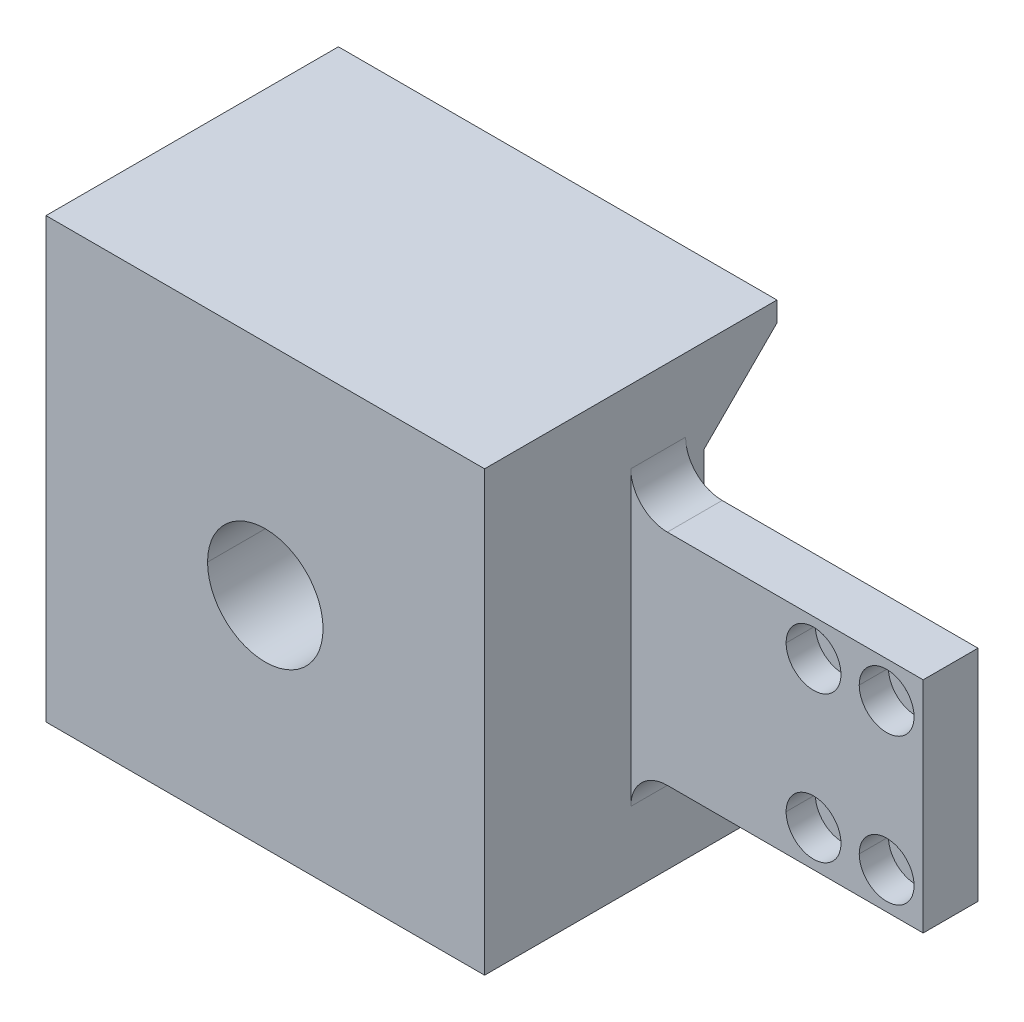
ISO-10303-21;
HEADER;
FILE_DESCRIPTION(('STEP AP214'),'2;1');
FILE_NAME('part.step','',(''),(''),'','','');
FILE_SCHEMA(('AUTOMOTIVE_DESIGN { 1 0 10303 214 1 1 1 1 }'));
ENDSEC;
DATA;
#1=APPLICATION_CONTEXT('core data for automotive mechanical design processes');
#2=APPLICATION_PROTOCOL_DEFINITION('international standard','automotive_design',2000,#1);
#3=PRODUCT_CONTEXT('',#1,'mechanical');
#4=PRODUCT('Part','Part','',(#3));
#5=PRODUCT_RELATED_PRODUCT_CATEGORY('part','',(#4));
#6=PRODUCT_DEFINITION_FORMATION('','',#4);
#7=PRODUCT_DEFINITION_CONTEXT('part definition',#1,'design');
#8=PRODUCT_DEFINITION('design','',#6,#7);
#9=PRODUCT_DEFINITION_SHAPE('','',#8);
#10=(LENGTH_UNIT() NAMED_UNIT(*) SI_UNIT(.MILLI.,.METRE.));
#11=(NAMED_UNIT(*) PLANE_ANGLE_UNIT() SI_UNIT($,.RADIAN.));
#12=(NAMED_UNIT(*) SI_UNIT($,.STERADIAN.) SOLID_ANGLE_UNIT());
#13=UNCERTAINTY_MEASURE_WITH_UNIT(LENGTH_MEASURE(1.E-05),#10,'distance_accuracy_value','');
#14=(GEOMETRIC_REPRESENTATION_CONTEXT(3) GLOBAL_UNCERTAINTY_ASSIGNED_CONTEXT((#13)) GLOBAL_UNIT_ASSIGNED_CONTEXT((#10,
#11,#12)) REPRESENTATION_CONTEXT('',''));
#15=CARTESIAN_POINT('',(0.,0.,0.));
#16=DIRECTION('',(0.,0.,1.));
#17=DIRECTION('',(1.,0.,0.));
#18=AXIS2_PLACEMENT_3D('',#15,#16,#17);
#19=CARTESIAN_POINT('',(57.15,12.7,-5.079999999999));
#20=DIRECTION('',(0.,0.,-1.));
#21=DIRECTION('',(0.,1.,0.));
#22=AXIS2_PLACEMENT_3D('',#19,#20,#21);
#23=PLANE('',#22);
#24=CARTESIAN_POINT('',(57.15,12.7,-5.079999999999));
#25=DIRECTION('',(0.,0.,-1.));
#26=DIRECTION('',(0.,1.,0.));
#27=AXIS2_PLACEMENT_3D('',#24,#25,#26);
#28=CIRCLE('',#27,2.4384);
#29=CARTESIAN_POINT('',(54.7116,12.7,-5.079999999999));
#30=VERTEX_POINT('',#29);
#31=CARTESIAN_POINT('',(59.5884,12.7,-5.07999999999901));
#32=VERTEX_POINT('',#31);
#33=EDGE_CURVE('E258',#30,#32,#28,.T.);
#34=ORIENTED_EDGE('',*,*,#33,.T.);
#35=CARTESIAN_POINT('',(57.15,12.7,-5.079999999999));
#36=DIRECTION('',(0.,0.,-1.));
#37=DIRECTION('',(0.,1.,0.));
#38=AXIS2_PLACEMENT_3D('',#35,#36,#37);
#39=CIRCLE('',#38,2.4384);
#40=EDGE_CURVE('E261',#32,#30,#39,.T.);
#41=ORIENTED_EDGE('',*,*,#40,.T.);
#42=EDGE_LOOP('',(#34,#41));
#43=FACE_BOUND('',#42,.T.);
#44=CARTESIAN_POINT('',(57.15,12.7,-5.07999999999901));
#45=DIRECTION('',(0.,0.,-1.));
#46=DIRECTION('',(0.,1.,0.));
#47=AXIS2_PLACEMENT_3D('',#44,#45,#46);
#48=CIRCLE('',#47,4.7625);
#49=CARTESIAN_POINT('',(52.3875,12.7,-5.079999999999));
#50=VERTEX_POINT('',#49);
#51=CARTESIAN_POINT('',(61.9125,12.7,-5.07999999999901));
#52=VERTEX_POINT('',#51);
#53=EDGE_CURVE('E19',#50,#52,#48,.F.);
#54=ORIENTED_EDGE('',*,*,#53,.T.);
#55=CARTESIAN_POINT('',(57.15,12.7,-5.079999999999));
#56=DIRECTION('',(0.,0.,-1.));
#57=DIRECTION('',(0.,1.,0.));
#58=AXIS2_PLACEMENT_3D('',#55,#56,#57);
#59=CIRCLE('',#58,4.7625);
#60=EDGE_CURVE('E222',#52,#50,#59,.F.);
#61=ORIENTED_EDGE('',*,*,#60,.T.);
#62=EDGE_LOOP('',(#54,#61));
#63=FACE_BOUND('',#62,.T.);
#64=ADVANCED_FACE('F16',(#43,#63),#23,.F.);
#65=CARTESIAN_POINT('',(44.45,12.7,-5.079999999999));
#66=DIRECTION('',(0.,0.,-1.));
#67=DIRECTION('',(0.,1.,0.));
#68=AXIS2_PLACEMENT_3D('',#65,#66,#67);
#69=PLANE('',#68);
#70=CARTESIAN_POINT('',(44.45,12.7,-5.079999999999));
#71=DIRECTION('',(0.,0.,-1.));
#72=DIRECTION('',(0.,1.,0.));
#73=AXIS2_PLACEMENT_3D('',#70,#71,#72);
#74=CIRCLE('',#73,2.4384);
#75=CARTESIAN_POINT('',(42.0116,12.7,-5.079999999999));
#76=VERTEX_POINT('',#75);
#77=CARTESIAN_POINT('',(46.8884,12.7,-5.07999999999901));
#78=VERTEX_POINT('',#77);
#79=EDGE_CURVE('E264',#76,#78,#74,.T.);
#80=ORIENTED_EDGE('',*,*,#79,.T.);
#81=CARTESIAN_POINT('',(44.45,12.7,-5.079999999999));
#82=DIRECTION('',(0.,0.,-1.));
#83=DIRECTION('',(0.,1.,0.));
#84=AXIS2_PLACEMENT_3D('',#81,#82,#83);
#85=CIRCLE('',#84,2.4384);
#86=EDGE_CURVE('E267',#78,#76,#85,.T.);
#87=ORIENTED_EDGE('',*,*,#86,.T.);
#88=EDGE_LOOP('',(#80,#87));
#89=FACE_BOUND('',#88,.T.);
#90=CARTESIAN_POINT('',(44.45,12.7,-5.07999999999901));
#91=DIRECTION('',(0.,0.,-1.));
#92=DIRECTION('',(0.,1.,0.));
#93=AXIS2_PLACEMENT_3D('',#90,#91,#92);
#94=CIRCLE('',#93,4.7625);
#95=CARTESIAN_POINT('',(39.6875,12.7,-5.079999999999));
#96=VERTEX_POINT('',#95);
#97=CARTESIAN_POINT('',(49.2125,12.7,-5.07999999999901));
#98=VERTEX_POINT('',#97);
#99=EDGE_CURVE('E238',#96,#98,#94,.F.);
#100=ORIENTED_EDGE('',*,*,#99,.T.);
#101=CARTESIAN_POINT('',(44.45,12.7,-5.079999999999));
#102=DIRECTION('',(0.,0.,-1.));
#103=DIRECTION('',(0.,1.,0.));
#104=AXIS2_PLACEMENT_3D('',#101,#102,#103);
#105=CIRCLE('',#104,4.7625);
#106=EDGE_CURVE('E243',#98,#96,#105,.F.);
#107=ORIENTED_EDGE('',*,*,#106,.T.);
#108=EDGE_LOOP('',(#100,#107));
#109=FACE_BOUND('',#108,.T.);
#110=ADVANCED_FACE('F807',(#89,#109),#69,.F.);
#111=CARTESIAN_POINT('',(44.45,-12.7,-5.079999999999));
#112=DIRECTION('',(0.,0.,-1.));
#113=DIRECTION('',(0.,1.,0.));
#114=AXIS2_PLACEMENT_3D('',#111,#112,#113);
#115=PLANE('',#114);
#116=CARTESIAN_POINT('',(44.45,-12.7,-5.079999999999));
#117=DIRECTION('',(0.,0.,-1.));
#118=DIRECTION('',(0.,1.,0.));
#119=AXIS2_PLACEMENT_3D('',#116,#117,#118);
#120=CIRCLE('',#119,2.4384);
#121=CARTESIAN_POINT('',(42.0116,-12.7,-5.079999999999));
#122=VERTEX_POINT('',#121);
#123=CARTESIAN_POINT('',(46.8884,-12.7,-5.07999999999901));
#124=VERTEX_POINT('',#123);
#125=EDGE_CURVE('E270',#122,#124,#120,.T.);
#126=ORIENTED_EDGE('',*,*,#125,.T.);
#127=CARTESIAN_POINT('',(44.45,-12.7,-5.079999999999));
#128=DIRECTION('',(0.,0.,-1.));
#129=DIRECTION('',(0.,1.,0.));
#130=AXIS2_PLACEMENT_3D('',#127,#128,#129);
#131=CIRCLE('',#130,2.4384);
#132=EDGE_CURVE('E273',#124,#122,#131,.T.);
#133=ORIENTED_EDGE('',*,*,#132,.T.);
#134=EDGE_LOOP('',(#126,#133));
#135=FACE_BOUND('',#134,.T.);
#136=CARTESIAN_POINT('',(44.45,-12.7,-5.07999999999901));
#137=DIRECTION('',(0.,0.,-1.));
#138=DIRECTION('',(0.,1.,0.));
#139=AXIS2_PLACEMENT_3D('',#136,#137,#138);
#140=CIRCLE('',#139,4.7625);
#141=CARTESIAN_POINT('',(39.6875,-12.7,-5.079999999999));
#142=VERTEX_POINT('',#141);
#143=CARTESIAN_POINT('',(49.2125,-12.7,-5.07999999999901));
#144=VERTEX_POINT('',#143);
#145=EDGE_CURVE('E246',#142,#144,#140,.F.);
#146=ORIENTED_EDGE('',*,*,#145,.T.);
#147=CARTESIAN_POINT('',(44.45,-12.7,-5.079999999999));
#148=DIRECTION('',(0.,0.,-1.));
#149=DIRECTION('',(0.,1.,0.));
#150=AXIS2_PLACEMENT_3D('',#147,#148,#149);
#151=CIRCLE('',#150,4.7625);
#152=EDGE_CURVE('E249',#144,#142,#151,.F.);
#153=ORIENTED_EDGE('',*,*,#152,.T.);
#154=EDGE_LOOP('',(#146,#153));
#155=FACE_BOUND('',#154,.T.);
#156=ADVANCED_FACE('F799',(#135,#155),#115,.F.);
#157=CARTESIAN_POINT('',(57.15,-12.7,-5.079999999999));
#158=DIRECTION('',(0.,0.,-1.));
#159=DIRECTION('',(0.,1.,0.));
#160=AXIS2_PLACEMENT_3D('',#157,#158,#159);
#161=PLANE('',#160);
#162=CARTESIAN_POINT('',(57.15,-12.7,-5.079999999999));
#163=DIRECTION('',(0.,0.,-1.));
#164=DIRECTION('',(0.,1.,0.));
#165=AXIS2_PLACEMENT_3D('',#162,#163,#164);
#166=CIRCLE('',#165,2.4384);
#167=CARTESIAN_POINT('',(54.7116,-12.7,-5.079999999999));
#168=VERTEX_POINT('',#167);
#169=CARTESIAN_POINT('',(59.5884,-12.7,-5.07999999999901));
#170=VERTEX_POINT('',#169);
#171=EDGE_CURVE('E276',#168,#170,#166,.T.);
#172=ORIENTED_EDGE('',*,*,#171,.T.);
#173=CARTESIAN_POINT('',(57.15,-12.7,-5.079999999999));
#174=DIRECTION('',(0.,0.,-1.));
#175=DIRECTION('',(0.,1.,0.));
#176=AXIS2_PLACEMENT_3D('',#173,#174,#175);
#177=CIRCLE('',#176,2.4384);
#178=EDGE_CURVE('E279',#170,#168,#177,.T.);
#179=ORIENTED_EDGE('',*,*,#178,.T.);
#180=EDGE_LOOP('',(#172,#179));
#181=FACE_BOUND('',#180,.T.);
#182=CARTESIAN_POINT('',(57.15,-12.7,-5.07999999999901));
#183=DIRECTION('',(0.,0.,-1.));
#184=DIRECTION('',(0.,1.,0.));
#185=AXIS2_PLACEMENT_3D('',#182,#183,#184);
#186=CIRCLE('',#185,4.7625);
#187=CARTESIAN_POINT('',(52.3875,-12.7,-5.079999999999));
#188=VERTEX_POINT('',#187);
#189=CARTESIAN_POINT('',(61.9125,-12.7,-5.07999999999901));
#190=VERTEX_POINT('',#189);
#191=EDGE_CURVE('E252',#188,#190,#186,.F.);
#192=ORIENTED_EDGE('',*,*,#191,.T.);
#193=CARTESIAN_POINT('',(57.15,-12.7,-5.079999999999));
#194=DIRECTION('',(0.,0.,-1.));
#195=DIRECTION('',(0.,1.,0.));
#196=AXIS2_PLACEMENT_3D('',#193,#194,#195);
#197=CIRCLE('',#196,4.7625);
#198=EDGE_CURVE('E255',#190,#188,#197,.F.);
#199=ORIENTED_EDGE('',*,*,#198,.T.);
#200=EDGE_LOOP('',(#192,#199));
#201=FACE_BOUND('',#200,.T.);
#202=ADVANCED_FACE('F792',(#181,#201),#161,.F.);
#203=CARTESIAN_POINT('',(57.15,12.7,-2.53999999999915));
#204=DIRECTION('',(0.,0.,-1.));
#205=DIRECTION('',(0.,1.,0.));
#206=AXIS2_PLACEMENT_3D('',#203,#204,#205);
#207=CYLINDRICAL_SURFACE('',#206,4.7625);
#208=CARTESIAN_POINT('',(57.15,12.7,1.42941214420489E-12));
#209=DIRECTION('',(0.,0.,-1.));
#210=DIRECTION('',(0.,1.,0.));
#211=AXIS2_PLACEMENT_3D('',#208,#209,#210);
#212=CIRCLE('',#211,4.7625);
#213=CARTESIAN_POINT('',(52.3875,12.7,1.0698907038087E-12));
#214=VERTEX_POINT('',#213);
#215=CARTESIAN_POINT('',(61.9125,12.7,1.06468653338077E-12));
#216=VERTEX_POINT('',#215);
#217=EDGE_CURVE('E231',#214,#216,#212,.F.);
#218=ORIENTED_EDGE('',*,*,#217,.T.);
#219=DIRECTION('',(0.,0.,-1.));
#220=VECTOR('',#219,1.);
#221=CARTESIAN_POINT('',(61.9125,12.7,-2.53999999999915));
#222=LINE('',#221,#220);
#223=EDGE_CURVE('E227',#216,#52,#222,.T.);
#224=ORIENTED_EDGE('',*,*,#223,.T.);
#225=ORIENTED_EDGE('',*,*,#53,.F.);
#226=DIRECTION('',(0.,0.,-1.));
#227=VECTOR('',#226,1.);
#228=CARTESIAN_POINT('',(52.3875,12.7,-2.53999999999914));
#229=LINE('',#228,#227);
#230=EDGE_CURVE('E237',#50,#214,#229,.F.);
#231=ORIENTED_EDGE('',*,*,#230,.T.);
#232=EDGE_LOOP('',(#218,#224,#225,#231));
#233=FACE_BOUND('',#232,.T.);
#234=ADVANCED_FACE('F229',(#233),#207,.F.);
#235=CARTESIAN_POINT('',(57.15,12.7,-2.53999999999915));
#236=DIRECTION('',(0.,0.,-1.));
#237=DIRECTION('',(0.,1.,0.));
#238=AXIS2_PLACEMENT_3D('',#235,#236,#237);
#239=CYLINDRICAL_SURFACE('',#238,4.7625);
#240=ORIENTED_EDGE('',*,*,#60,.F.);
#241=ORIENTED_EDGE('',*,*,#223,.F.);
#242=CARTESIAN_POINT('',(57.15,12.7,7.05165092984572E-13));
#243=DIRECTION('',(0.,0.,-1.));
#244=DIRECTION('',(0.,1.,0.));
#245=AXIS2_PLACEMENT_3D('',#242,#243,#244);
#246=CIRCLE('',#245,4.7625);
#247=EDGE_CURVE('E283',#216,#214,#246,.F.);
#248=ORIENTED_EDGE('',*,*,#247,.T.);
#249=ORIENTED_EDGE('',*,*,#230,.F.);
#250=EDGE_LOOP('',(#240,#241,#248,#249));
#251=FACE_BOUND('',#250,.T.);
#252=ADVANCED_FACE('F236',(#251),#239,.F.);
#253=CARTESIAN_POINT('',(44.45,12.7,-2.53999999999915));
#254=DIRECTION('',(0.,0.,-1.));
#255=DIRECTION('',(0.,1.,0.));
#256=AXIS2_PLACEMENT_3D('',#253,#254,#255);
#257=CYLINDRICAL_SURFACE('',#256,4.7625);
#258=CARTESIAN_POINT('',(44.45,12.7,1.42941214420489E-12));
#259=DIRECTION('',(0.,0.,-1.));
#260=DIRECTION('',(0.,1.,0.));
#261=AXIS2_PLACEMENT_3D('',#258,#259,#260);
#262=CIRCLE('',#261,4.7625);
#263=CARTESIAN_POINT('',(39.6875,12.7,1.0698907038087E-12));
#264=VERTEX_POINT('',#263);
#265=CARTESIAN_POINT('',(49.2125,12.7,1.06468653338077E-12));
#266=VERTEX_POINT('',#265);
#267=EDGE_CURVE('E286',#264,#266,#262,.F.);
#268=ORIENTED_EDGE('',*,*,#267,.T.);
#269=DIRECTION('',(0.,0.,-1.));
#270=VECTOR('',#269,1.);
#271=CARTESIAN_POINT('',(49.2125,12.7,-2.53999999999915));
#272=LINE('',#271,#270);
#273=EDGE_CURVE('E242',#266,#98,#272,.T.);
#274=ORIENTED_EDGE('',*,*,#273,.T.);
#275=ORIENTED_EDGE('',*,*,#99,.F.);
#276=DIRECTION('',(0.,0.,-1.));
#277=VECTOR('',#276,1.);
#278=CARTESIAN_POINT('',(39.6875,12.7,-2.53999999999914));
#279=LINE('',#278,#277);
#280=EDGE_CURVE('E245',#96,#264,#279,.F.);
#281=ORIENTED_EDGE('',*,*,#280,.T.);
#282=EDGE_LOOP('',(#268,#274,#275,#281));
#283=FACE_BOUND('',#282,.T.);
#284=ADVANCED_FACE('F771',(#283),#257,.F.);
#285=CARTESIAN_POINT('',(44.45,12.7,-2.53999999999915));
#286=DIRECTION('',(0.,0.,-1.));
#287=DIRECTION('',(0.,1.,0.));
#288=AXIS2_PLACEMENT_3D('',#285,#286,#287);
#289=CYLINDRICAL_SURFACE('',#288,4.7625);
#290=ORIENTED_EDGE('',*,*,#106,.F.);
#291=ORIENTED_EDGE('',*,*,#273,.F.);
#292=CARTESIAN_POINT('',(44.45,12.7,7.05165092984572E-13));
#293=DIRECTION('',(0.,0.,-1.));
#294=DIRECTION('',(0.,1.,0.));
#295=AXIS2_PLACEMENT_3D('',#292,#293,#294);
#296=CIRCLE('',#295,4.7625);
#297=EDGE_CURVE('E288',#266,#264,#296,.F.);
#298=ORIENTED_EDGE('',*,*,#297,.T.);
#299=ORIENTED_EDGE('',*,*,#280,.F.);
#300=EDGE_LOOP('',(#290,#291,#298,#299));
#301=FACE_BOUND('',#300,.T.);
#302=ADVANCED_FACE('F763',(#301),#289,.F.);
#303=CARTESIAN_POINT('',(44.45,-12.7,-2.53999999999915));
#304=DIRECTION('',(0.,0.,-1.));
#305=DIRECTION('',(0.,1.,0.));
#306=AXIS2_PLACEMENT_3D('',#303,#304,#305);
#307=CYLINDRICAL_SURFACE('',#306,4.7625);
#308=CARTESIAN_POINT('',(44.45,-12.7,1.42941214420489E-12));
#309=DIRECTION('',(0.,0.,-1.));
#310=DIRECTION('',(0.,1.,0.));
#311=AXIS2_PLACEMENT_3D('',#308,#309,#310);
#312=CIRCLE('',#311,4.7625);
#313=CARTESIAN_POINT('',(39.6875,-12.7,1.0698907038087E-12));
#314=VERTEX_POINT('',#313);
#315=CARTESIAN_POINT('',(49.2125,-12.7,1.06468653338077E-12));
#316=VERTEX_POINT('',#315);
#317=EDGE_CURVE('E291',#314,#316,#312,.F.);
#318=ORIENTED_EDGE('',*,*,#317,.T.);
#319=DIRECTION('',(0.,0.,-1.));
#320=VECTOR('',#319,1.);
#321=CARTESIAN_POINT('',(49.2125,-12.7,-2.53999999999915));
#322=LINE('',#321,#320);
#323=EDGE_CURVE('E248',#316,#144,#322,.T.);
#324=ORIENTED_EDGE('',*,*,#323,.T.);
#325=ORIENTED_EDGE('',*,*,#145,.F.);
#326=DIRECTION('',(0.,0.,-1.));
#327=VECTOR('',#326,1.);
#328=CARTESIAN_POINT('',(39.6875,-12.7,-2.53999999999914));
#329=LINE('',#328,#327);
#330=EDGE_CURVE('E251',#142,#314,#329,.F.);
#331=ORIENTED_EDGE('',*,*,#330,.T.);
#332=EDGE_LOOP('',(#318,#324,#325,#331));
#333=FACE_BOUND('',#332,.T.);
#334=ADVANCED_FACE('F755',(#333),#307,.F.);
#335=CARTESIAN_POINT('',(44.45,-12.7,-2.53999999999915));
#336=DIRECTION('',(0.,0.,-1.));
#337=DIRECTION('',(0.,1.,0.));
#338=AXIS2_PLACEMENT_3D('',#335,#336,#337);
#339=CYLINDRICAL_SURFACE('',#338,4.7625);
#340=ORIENTED_EDGE('',*,*,#152,.F.);
#341=ORIENTED_EDGE('',*,*,#323,.F.);
#342=CARTESIAN_POINT('',(44.45,-12.7,7.05165092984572E-13));
#343=DIRECTION('',(0.,0.,-1.));
#344=DIRECTION('',(0.,1.,0.));
#345=AXIS2_PLACEMENT_3D('',#342,#343,#344);
#346=CIRCLE('',#345,4.7625);
#347=EDGE_CURVE('E293',#316,#314,#346,.F.);
#348=ORIENTED_EDGE('',*,*,#347,.T.);
#349=ORIENTED_EDGE('',*,*,#330,.F.);
#350=EDGE_LOOP('',(#340,#341,#348,#349));
#351=FACE_BOUND('',#350,.T.);
#352=ADVANCED_FACE('F747',(#351),#339,.F.);
#353=CARTESIAN_POINT('',(57.15,-12.7,-2.53999999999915));
#354=DIRECTION('',(0.,0.,-1.));
#355=DIRECTION('',(0.,1.,0.));
#356=AXIS2_PLACEMENT_3D('',#353,#354,#355);
#357=CYLINDRICAL_SURFACE('',#356,4.7625);
#358=CARTESIAN_POINT('',(57.15,-12.7,1.42941214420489E-12));
#359=DIRECTION('',(0.,0.,-1.));
#360=DIRECTION('',(0.,1.,0.));
#361=AXIS2_PLACEMENT_3D('',#358,#359,#360);
#362=CIRCLE('',#361,4.7625);
#363=CARTESIAN_POINT('',(52.3875,-12.7,1.0698907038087E-12));
#364=VERTEX_POINT('',#363);
#365=CARTESIAN_POINT('',(61.9125,-12.7,1.06468653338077E-12));
#366=VERTEX_POINT('',#365);
#367=EDGE_CURVE('E296',#364,#366,#362,.F.);
#368=ORIENTED_EDGE('',*,*,#367,.T.);
#369=DIRECTION('',(0.,0.,-1.));
#370=VECTOR('',#369,1.);
#371=CARTESIAN_POINT('',(61.9125,-12.7,-2.53999999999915));
#372=LINE('',#371,#370);
#373=EDGE_CURVE('E254',#366,#190,#372,.T.);
#374=ORIENTED_EDGE('',*,*,#373,.T.);
#375=ORIENTED_EDGE('',*,*,#191,.F.);
#376=DIRECTION('',(0.,0.,-1.));
#377=VECTOR('',#376,1.);
#378=CARTESIAN_POINT('',(52.3875,-12.7,-2.53999999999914));
#379=LINE('',#378,#377);
#380=EDGE_CURVE('E257',#188,#364,#379,.F.);
#381=ORIENTED_EDGE('',*,*,#380,.T.);
#382=EDGE_LOOP('',(#368,#374,#375,#381));
#383=FACE_BOUND('',#382,.T.);
#384=ADVANCED_FACE('F739',(#383),#357,.F.);
#385=CARTESIAN_POINT('',(57.15,-12.7,-2.53999999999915));
#386=DIRECTION('',(0.,0.,-1.));
#387=DIRECTION('',(0.,1.,0.));
#388=AXIS2_PLACEMENT_3D('',#385,#386,#387);
#389=CYLINDRICAL_SURFACE('',#388,4.7625);
#390=ORIENTED_EDGE('',*,*,#198,.F.);
#391=ORIENTED_EDGE('',*,*,#373,.F.);
#392=CARTESIAN_POINT('',(57.15,-12.7,7.05165092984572E-13));
#393=DIRECTION('',(0.,0.,-1.));
#394=DIRECTION('',(0.,1.,0.));
#395=AXIS2_PLACEMENT_3D('',#392,#393,#394);
#396=CIRCLE('',#395,4.7625);
#397=EDGE_CURVE('E298',#366,#364,#396,.F.);
#398=ORIENTED_EDGE('',*,*,#397,.T.);
#399=ORIENTED_EDGE('',*,*,#380,.F.);
#400=EDGE_LOOP('',(#390,#391,#398,#399));
#401=FACE_BOUND('',#400,.T.);
#402=ADVANCED_FACE('F731',(#401),#389,.F.);
#403=CARTESIAN_POINT('',(57.15,12.7,-11.429999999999));
#404=DIRECTION('',(0.,0.,-1.));
#405=DIRECTION('',(0.,1.,0.));
#406=AXIS2_PLACEMENT_3D('',#403,#404,#405);
#407=CYLINDRICAL_SURFACE('',#406,2.4384);
#408=CARTESIAN_POINT('',(57.15,12.7,-9.52499999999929));
#409=DIRECTION('',(0.,0.,-1.));
#410=DIRECTION('',(0.,1.,0.));
#411=AXIS2_PLACEMENT_3D('',#408,#409,#410);
#412=CIRCLE('',#411,2.4384);
#413=CARTESIAN_POINT('',(59.5884,12.7,-9.52499999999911));
#414=VERTEX_POINT('',#413);
#415=CARTESIAN_POINT('',(54.7116,12.7,-9.52499999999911));
#416=VERTEX_POINT('',#415);
#417=EDGE_CURVE('E310',#414,#416,#412,.F.);
#418=ORIENTED_EDGE('',*,*,#417,.F.);
#419=DIRECTION('',(0.,0.,-1.));
#420=VECTOR('',#419,1.);
#421=CARTESIAN_POINT('',(59.5884,12.7,-11.429999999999));
#422=LINE('',#421,#420);
#423=EDGE_CURVE('E260',#414,#32,#422,.F.);
#424=ORIENTED_EDGE('',*,*,#423,.T.);
#425=ORIENTED_EDGE('',*,*,#33,.F.);
#426=DIRECTION('',(0.,0.,-1.));
#427=VECTOR('',#426,1.);
#428=CARTESIAN_POINT('',(54.7116,12.7,-11.429999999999));
#429=LINE('',#428,#427);
#430=EDGE_CURVE('E263',#30,#416,#429,.T.);
#431=ORIENTED_EDGE('',*,*,#430,.T.);
#432=EDGE_LOOP('',(#418,#424,#425,#431));
#433=FACE_BOUND('',#432,.T.);
#434=ADVANCED_FACE('F723',(#433),#407,.F.);
#435=CARTESIAN_POINT('',(57.15,12.7,-11.429999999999));
#436=DIRECTION('',(0.,0.,-1.));
#437=DIRECTION('',(0.,1.,0.));
#438=AXIS2_PLACEMENT_3D('',#435,#436,#437);
#439=CYLINDRICAL_SURFACE('',#438,2.4384);
#440=ORIENTED_EDGE('',*,*,#40,.F.);
#441=ORIENTED_EDGE('',*,*,#423,.F.);
#442=CARTESIAN_POINT('',(57.15,12.7,-9.52499999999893));
#443=DIRECTION('',(0.,0.,-1.));
#444=DIRECTION('',(0.,1.,0.));
#445=AXIS2_PLACEMENT_3D('',#442,#443,#444);
#446=CIRCLE('',#445,2.4384);
#447=EDGE_CURVE('E313',#416,#414,#446,.F.);
#448=ORIENTED_EDGE('',*,*,#447,.F.);
#449=ORIENTED_EDGE('',*,*,#430,.F.);
#450=EDGE_LOOP('',(#440,#441,#448,#449));
#451=FACE_BOUND('',#450,.T.);
#452=ADVANCED_FACE('F715',(#451),#439,.F.);
#453=CARTESIAN_POINT('',(44.45,12.7,-11.429999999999));
#454=DIRECTION('',(0.,0.,-1.));
#455=DIRECTION('',(0.,1.,0.));
#456=AXIS2_PLACEMENT_3D('',#453,#454,#455);
#457=CYLINDRICAL_SURFACE('',#456,2.4384);
#458=CARTESIAN_POINT('',(44.45,12.7,-9.52499999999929));
#459=DIRECTION('',(0.,0.,-1.));
#460=DIRECTION('',(0.,1.,0.));
#461=AXIS2_PLACEMENT_3D('',#458,#459,#460);
#462=CIRCLE('',#461,2.4384);
#463=CARTESIAN_POINT('',(46.8884,12.7,-9.52499999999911));
#464=VERTEX_POINT('',#463);
#465=CARTESIAN_POINT('',(42.0116,12.7,-9.52499999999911));
#466=VERTEX_POINT('',#465);
#467=EDGE_CURVE('E316',#464,#466,#462,.F.);
#468=ORIENTED_EDGE('',*,*,#467,.F.);
#469=DIRECTION('',(0.,0.,-1.));
#470=VECTOR('',#469,1.);
#471=CARTESIAN_POINT('',(46.8884,12.7,-11.429999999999));
#472=LINE('',#471,#470);
#473=EDGE_CURVE('E266',#464,#78,#472,.F.);
#474=ORIENTED_EDGE('',*,*,#473,.T.);
#475=ORIENTED_EDGE('',*,*,#79,.F.);
#476=DIRECTION('',(0.,0.,-1.));
#477=VECTOR('',#476,1.);
#478=CARTESIAN_POINT('',(42.0116,12.7,-11.429999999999));
#479=LINE('',#478,#477);
#480=EDGE_CURVE('E269',#76,#466,#479,.T.);
#481=ORIENTED_EDGE('',*,*,#480,.T.);
#482=EDGE_LOOP('',(#468,#474,#475,#481));
#483=FACE_BOUND('',#482,.T.);
#484=ADVANCED_FACE('F707',(#483),#457,.F.);
#485=CARTESIAN_POINT('',(44.45,12.7,-11.429999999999));
#486=DIRECTION('',(0.,0.,-1.));
#487=DIRECTION('',(0.,1.,0.));
#488=AXIS2_PLACEMENT_3D('',#485,#486,#487);
#489=CYLINDRICAL_SURFACE('',#488,2.4384);
#490=ORIENTED_EDGE('',*,*,#86,.F.);
#491=ORIENTED_EDGE('',*,*,#473,.F.);
#492=CARTESIAN_POINT('',(44.45,12.7,-9.52499999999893));
#493=DIRECTION('',(0.,0.,-1.));
#494=DIRECTION('',(0.,1.,0.));
#495=AXIS2_PLACEMENT_3D('',#492,#493,#494);
#496=CIRCLE('',#495,2.4384);
#497=EDGE_CURVE('E319',#466,#464,#496,.F.);
#498=ORIENTED_EDGE('',*,*,#497,.F.);
#499=ORIENTED_EDGE('',*,*,#480,.F.);
#500=EDGE_LOOP('',(#490,#491,#498,#499));
#501=FACE_BOUND('',#500,.T.);
#502=ADVANCED_FACE('F699',(#501),#489,.F.);
#503=CARTESIAN_POINT('',(44.45,-12.7,-11.429999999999));
#504=DIRECTION('',(0.,0.,-1.));
#505=DIRECTION('',(0.,1.,0.));
#506=AXIS2_PLACEMENT_3D('',#503,#504,#505);
#507=CYLINDRICAL_SURFACE('',#506,2.4384);
#508=CARTESIAN_POINT('',(44.45,-12.7,-9.52499999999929));
#509=DIRECTION('',(0.,0.,-1.));
#510=DIRECTION('',(0.,1.,0.));
#511=AXIS2_PLACEMENT_3D('',#508,#509,#510);
#512=CIRCLE('',#511,2.4384);
#513=CARTESIAN_POINT('',(46.8884,-12.7,-9.52499999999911));
#514=VERTEX_POINT('',#513);
#515=CARTESIAN_POINT('',(42.0116,-12.7,-9.52499999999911));
#516=VERTEX_POINT('',#515);
#517=EDGE_CURVE('E322',#514,#516,#512,.F.);
#518=ORIENTED_EDGE('',*,*,#517,.F.);
#519=DIRECTION('',(0.,0.,-1.));
#520=VECTOR('',#519,1.);
#521=CARTESIAN_POINT('',(46.8884,-12.7,-11.429999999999));
#522=LINE('',#521,#520);
#523=EDGE_CURVE('E272',#514,#124,#522,.F.);
#524=ORIENTED_EDGE('',*,*,#523,.T.);
#525=ORIENTED_EDGE('',*,*,#125,.F.);
#526=DIRECTION('',(0.,0.,-1.));
#527=VECTOR('',#526,1.);
#528=CARTESIAN_POINT('',(42.0116,-12.7,-11.429999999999));
#529=LINE('',#528,#527);
#530=EDGE_CURVE('E275',#122,#516,#529,.T.);
#531=ORIENTED_EDGE('',*,*,#530,.T.);
#532=EDGE_LOOP('',(#518,#524,#525,#531));
#533=FACE_BOUND('',#532,.T.);
#534=ADVANCED_FACE('F691',(#533),#507,.F.);
#535=CARTESIAN_POINT('',(44.45,-12.7,-11.429999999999));
#536=DIRECTION('',(0.,0.,-1.));
#537=DIRECTION('',(0.,1.,0.));
#538=AXIS2_PLACEMENT_3D('',#535,#536,#537);
#539=CYLINDRICAL_SURFACE('',#538,2.4384);
#540=ORIENTED_EDGE('',*,*,#132,.F.);
#541=ORIENTED_EDGE('',*,*,#523,.F.);
#542=CARTESIAN_POINT('',(44.45,-12.7,-9.52499999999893));
#543=DIRECTION('',(0.,0.,-1.));
#544=DIRECTION('',(0.,1.,0.));
#545=AXIS2_PLACEMENT_3D('',#542,#543,#544);
#546=CIRCLE('',#545,2.4384);
#547=EDGE_CURVE('E325',#516,#514,#546,.F.);
#548=ORIENTED_EDGE('',*,*,#547,.F.);
#549=ORIENTED_EDGE('',*,*,#530,.F.);
#550=EDGE_LOOP('',(#540,#541,#548,#549));
#551=FACE_BOUND('',#550,.T.);
#552=ADVANCED_FACE('F683',(#551),#539,.F.);
#553=CARTESIAN_POINT('',(57.15,-12.7,-11.429999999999));
#554=DIRECTION('',(0.,0.,-1.));
#555=DIRECTION('',(0.,1.,0.));
#556=AXIS2_PLACEMENT_3D('',#553,#554,#555);
#557=CYLINDRICAL_SURFACE('',#556,2.4384);
#558=CARTESIAN_POINT('',(57.15,-12.7,-9.52499999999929));
#559=DIRECTION('',(0.,0.,-1.));
#560=DIRECTION('',(0.,1.,0.));
#561=AXIS2_PLACEMENT_3D('',#558,#559,#560);
#562=CIRCLE('',#561,2.4384);
#563=CARTESIAN_POINT('',(59.5884,-12.7,-9.52499999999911));
#564=VERTEX_POINT('',#563);
#565=CARTESIAN_POINT('',(54.7116,-12.7,-9.52499999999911));
#566=VERTEX_POINT('',#565);
#567=EDGE_CURVE('E328',#564,#566,#562,.F.);
#568=ORIENTED_EDGE('',*,*,#567,.F.);
#569=DIRECTION('',(0.,0.,-1.));
#570=VECTOR('',#569,1.);
#571=CARTESIAN_POINT('',(59.5884,-12.7,-11.429999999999));
#572=LINE('',#571,#570);
#573=EDGE_CURVE('E278',#564,#170,#572,.F.);
#574=ORIENTED_EDGE('',*,*,#573,.T.);
#575=ORIENTED_EDGE('',*,*,#171,.F.);
#576=DIRECTION('',(0.,0.,-1.));
#577=VECTOR('',#576,1.);
#578=CARTESIAN_POINT('',(54.7116,-12.7,-11.429999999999));
#579=LINE('',#578,#577);
#580=EDGE_CURVE('E281',#168,#566,#579,.T.);
#581=ORIENTED_EDGE('',*,*,#580,.T.);
#582=EDGE_LOOP('',(#568,#574,#575,#581));
#583=FACE_BOUND('',#582,.T.);
#584=ADVANCED_FACE('F675',(#583),#557,.F.);
#585=CARTESIAN_POINT('',(57.15,-12.7,-11.429999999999));
#586=DIRECTION('',(0.,0.,-1.));
#587=DIRECTION('',(0.,1.,0.));
#588=AXIS2_PLACEMENT_3D('',#585,#586,#587);
#589=CYLINDRICAL_SURFACE('',#588,2.4384);
#590=ORIENTED_EDGE('',*,*,#178,.F.);
#591=ORIENTED_EDGE('',*,*,#573,.F.);
#592=CARTESIAN_POINT('',(57.15,-12.7,-9.52499999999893));
#593=DIRECTION('',(0.,0.,-1.));
#594=DIRECTION('',(0.,1.,0.));
#595=AXIS2_PLACEMENT_3D('',#592,#593,#594);
#596=CIRCLE('',#595,2.4384);
#597=EDGE_CURVE('E331',#566,#564,#596,.F.);
#598=ORIENTED_EDGE('',*,*,#597,.F.);
#599=ORIENTED_EDGE('',*,*,#580,.F.);
#600=EDGE_LOOP('',(#590,#591,#598,#599));
#601=FACE_BOUND('',#600,.T.);
#602=ADVANCED_FACE('F556',(#601),#589,.F.);
#603=CARTESIAN_POINT('',(38.1,-19.0499999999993,-4.76249999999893));
#604=DIRECTION('',(0.,-1.,0.));
#605=DIRECTION('',(0.,0.,-1.));
#606=AXIS2_PLACEMENT_3D('',#603,#604,#605);
#607=PLANE('',#606);
#608=DIRECTION('',(0.,0.,-1.));
#609=VECTOR('',#608,1.);
#610=CARTESIAN_POINT('',(63.5,-19.0499999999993,1.06876729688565E-12));
#611=LINE('',#610,#609);
#612=CARTESIAN_POINT('',(63.5,-19.0499999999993,1.41808708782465E-12));
#613=VERTEX_POINT('',#612);
#614=CARTESIAN_POINT('',(63.5,-19.0499999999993,-9.5249999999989));
#615=VERTEX_POINT('',#614);
#616=EDGE_CURVE('E382',#613,#615,#611,.T.);
#617=ORIENTED_EDGE('',*,*,#616,.F.);
#618=DIRECTION('',(1.,0.,0.));
#619=VECTOR('',#618,1.);
#620=CARTESIAN_POINT('',(9.525,-19.0499999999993,1.44284865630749E-12));
#621=LINE('',#620,#619);
#622=CARTESIAN_POINT('',(19.05,-19.0499999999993,1.25296249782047E-12));
#623=VERTEX_POINT('',#622);
#624=EDGE_CURVE('E309',#613,#623,#621,.F.);
#625=ORIENTED_EDGE('',*,*,#624,.T.);
#626=DIRECTION('',(0.,0.,1.));
#627=VECTOR('',#626,1.);
#628=CARTESIAN_POINT('',(19.05,-19.0499999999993,-4.76249999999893));
#629=LINE('',#628,#627);
#630=CARTESIAN_POINT('',(19.05,-19.0499999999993,-9.5249999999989));
#631=VERTEX_POINT('',#630);
#632=EDGE_CURVE('E308',#623,#631,#629,.F.);
#633=ORIENTED_EDGE('',*,*,#632,.T.);
#634=DIRECTION('',(1.,0.,0.));
#635=VECTOR('',#634,1.);
#636=CARTESIAN_POINT('',(63.5,-19.0499999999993,-9.5249999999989));
#637=LINE('',#636,#635);
#638=EDGE_CURVE('E334',#615,#631,#637,.F.);
#639=ORIENTED_EDGE('',*,*,#638,.F.);
#640=EDGE_LOOP('',(#617,#625,#633,#639));
#641=FACE_BOUND('',#640,.T.);
#642=ADVANCED_FACE('F533',(#641),#607,.T.);
#643=CARTESIAN_POINT('',(38.1,19.05,-4.76249999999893));
#644=DIRECTION('',(0.,1.,0.));
#645=DIRECTION('',(0.,0.,1.));
#646=AXIS2_PLACEMENT_3D('',#643,#644,#645);
#647=PLANE('',#646);
#648=DIRECTION('',(0.,0.,-1.));
#649=VECTOR('',#648,1.);
#650=CARTESIAN_POINT('',(63.5,19.05,1.06876729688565E-12));
#651=LINE('',#650,#649);
#652=CARTESIAN_POINT('',(63.5,19.05,-9.52499999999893));
#653=VERTEX_POINT('',#652);
#654=CARTESIAN_POINT('',(63.5,19.05,1.40058622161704E-12));
#655=VERTEX_POINT('',#654);
#656=EDGE_CURVE('E387',#653,#655,#651,.F.);
#657=ORIENTED_EDGE('',*,*,#656,.F.);
#658=DIRECTION('',(1.,0.,0.));
#659=VECTOR('',#658,1.);
#660=CARTESIAN_POINT('',(63.5,19.05,-9.52499999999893));
#661=LINE('',#660,#659);
#662=CARTESIAN_POINT('',(19.05,19.05,-9.52499999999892));
#663=VERTEX_POINT('',#662);
#664=EDGE_CURVE('E341',#663,#653,#661,.T.);
#665=ORIENTED_EDGE('',*,*,#664,.F.);
#666=DIRECTION('',(0.,0.,1.));
#667=VECTOR('',#666,1.);
#668=CARTESIAN_POINT('',(19.05,19.05,-4.76249999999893));
#669=LINE('',#668,#667);
#670=CARTESIAN_POINT('',(19.05,19.05,1.2398944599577E-12));
#671=VERTEX_POINT('',#670);
#672=EDGE_CURVE('E284',#663,#671,#669,.T.);
#673=ORIENTED_EDGE('',*,*,#672,.T.);
#674=DIRECTION('',(1.,0.,0.));
#675=VECTOR('',#674,1.);
#676=CARTESIAN_POINT('',(9.525,19.05,1.41659735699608E-12));
#677=LINE('',#676,#675);
#678=EDGE_CURVE('E304',#671,#655,#677,.T.);
#679=ORIENTED_EDGE('',*,*,#678,.T.);
#680=EDGE_LOOP('',(#657,#665,#673,#679));
#681=FACE_BOUND('',#680,.T.);
#682=ADVANCED_FACE('F547',(#681),#647,.T.);
#683=CARTESIAN_POINT('',(63.5,-23.8125,1.06876729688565E-12));
#684=DIRECTION('',(1.,0.,0.));
#685=DIRECTION('',(0.,0.,-1.));
#686=AXIS2_PLACEMENT_3D('',#683,#684,#685);
#687=PLANE('',#686);
#688=ORIENTED_EDGE('',*,*,#656,.T.);
#689=DIRECTION('',(0.,1.,0.));
#690=VECTOR('',#689,1.);
#691=CARTESIAN_POINT('',(63.5,0.,1.39914347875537E-12));
#692=LINE('',#691,#690);
#693=EDGE_CURVE('E367',#655,#613,#692,.F.);
#694=ORIENTED_EDGE('',*,*,#693,.T.);
#695=ORIENTED_EDGE('',*,*,#616,.T.);
#696=DIRECTION('',(0.,1.,0.));
#697=VECTOR('',#696,1.);
#698=CARTESIAN_POINT('',(63.5,23.8125,-9.52499999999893));
#699=LINE('',#698,#697);
#700=EDGE_CURVE('E396',#653,#615,#699,.F.);
#701=ORIENTED_EDGE('',*,*,#700,.F.);
#702=EDGE_LOOP('',(#688,#694,#695,#701));
#703=FACE_BOUND('',#702,.T.);
#704=ADVANCED_FACE('F535',(#703),#687,.T.);
#705=CARTESIAN_POINT('',(19.05,25.4,-4.76249999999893));
#706=DIRECTION('',(0.,0.,1.));
#707=DIRECTION('',(1.,0.,0.));
#708=AXIS2_PLACEMENT_3D('',#705,#706,#707);
#709=CYLINDRICAL_SURFACE('',#708,6.35);
#710=CARTESIAN_POINT('',(19.05,25.4,1.06858966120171E-12));
#711=DIRECTION('',(0.,0.,1.));
#712=DIRECTION('',(1.,0.,0.));
#713=AXIS2_PLACEMENT_3D('',#710,#711,#712);
#714=CIRCLE('',#713,6.35);
#715=CARTESIAN_POINT('',(12.7,25.4,1.06858966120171E-12));
#716=VERTEX_POINT('',#715);
#717=EDGE_CURVE('E301',#716,#671,#714,.T.);
#718=ORIENTED_EDGE('',*,*,#717,.T.);
#719=ORIENTED_EDGE('',*,*,#672,.F.);
#720=CARTESIAN_POINT('',(19.05,25.4,-9.52499999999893));
#721=DIRECTION('',(0.,0.,1.));
#722=DIRECTION('',(1.,0.,0.));
#723=AXIS2_PLACEMENT_3D('',#720,#721,#722);
#724=CIRCLE('',#723,6.35);
#725=CARTESIAN_POINT('',(12.7,25.4,-9.52499999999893));
#726=VERTEX_POINT('',#725);
#727=EDGE_CURVE('E338',#726,#663,#724,.T.);
#728=ORIENTED_EDGE('',*,*,#727,.F.);
#729=DIRECTION('',(0.,0.,1.));
#730=VECTOR('',#729,1.);
#731=CARTESIAN_POINT('',(12.7,25.4,19.05));
#732=LINE('',#731,#730);
#733=EDGE_CURVE('E409',#726,#716,#732,.T.);
#734=ORIENTED_EDGE('',*,*,#733,.T.);
#735=EDGE_LOOP('',(#718,#719,#728,#734));
#736=FACE_BOUND('',#735,.T.);
#737=ADVANCED_FACE('F544',(#736),#709,.F.);
#738=CARTESIAN_POINT('',(9.525,0.,1.42972300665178E-12));
#739=DIRECTION('',(0.,0.,-1.));
#740=DIRECTION('',(0.,1.,0.));
#741=AXIS2_PLACEMENT_3D('',#738,#739,#740);
#742=PLANE('',#741);
#743=ORIENTED_EDGE('',*,*,#693,.F.);
#744=ORIENTED_EDGE('',*,*,#678,.F.);
#745=ORIENTED_EDGE('',*,*,#717,.F.);
#746=DIRECTION('',(0.,1.,0.));
#747=VECTOR('',#746,1.);
#748=CARTESIAN_POINT('',(12.7,0.,1.06858966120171E-12));
#749=LINE('',#748,#747);
#750=CARTESIAN_POINT('',(12.7,-25.3999999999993,1.06858966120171E-12));
#751=VERTEX_POINT('',#750);
#752=EDGE_CURVE('E406',#716,#751,#749,.F.);
#753=ORIENTED_EDGE('',*,*,#752,.T.);
#754=CARTESIAN_POINT('',(19.05,-25.3999999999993,1.06858966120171E-12));
#755=DIRECTION('',(0.,0.,1.));
#756=DIRECTION('',(1.,0.,0.));
#757=AXIS2_PLACEMENT_3D('',#754,#755,#756);
#758=CIRCLE('',#757,6.35);
#759=EDGE_CURVE('E305',#751,#623,#758,.F.);
#760=ORIENTED_EDGE('',*,*,#759,.T.);
#761=ORIENTED_EDGE('',*,*,#624,.F.);
#762=EDGE_LOOP('',(#743,#744,#745,#753,#760,#761));
#763=FACE_BOUND('',#762,.T.);
#764=ORIENTED_EDGE('',*,*,#367,.F.);
#765=ORIENTED_EDGE('',*,*,#397,.F.);
#766=EDGE_LOOP('',(#764,#765));
#767=FACE_BOUND('',#766,.T.);
#768=ORIENTED_EDGE('',*,*,#317,.F.);
#769=ORIENTED_EDGE('',*,*,#347,.F.);
#770=EDGE_LOOP('',(#768,#769));
#771=FACE_BOUND('',#770,.T.);
#772=ORIENTED_EDGE('',*,*,#267,.F.);
#773=ORIENTED_EDGE('',*,*,#297,.F.);
#774=EDGE_LOOP('',(#772,#773));
#775=FACE_BOUND('',#774,.T.);
#776=ORIENTED_EDGE('',*,*,#217,.F.);
#777=ORIENTED_EDGE('',*,*,#247,.F.);
#778=EDGE_LOOP('',(#776,#777));
#779=FACE_BOUND('',#778,.T.);
#780=ADVANCED_FACE('F540',(#763,#767,#771,#775,#779),#742,.F.);
#781=CARTESIAN_POINT('',(19.05,-25.3999999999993,-4.76249999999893));
#782=DIRECTION('',(0.,0.,1.));
#783=DIRECTION('',(1.,0.,0.));
#784=AXIS2_PLACEMENT_3D('',#781,#782,#783);
#785=CYLINDRICAL_SURFACE('',#784,6.35);
#786=ORIENTED_EDGE('',*,*,#759,.F.);
#787=DIRECTION('',(0.,0.,1.));
#788=VECTOR('',#787,1.);
#789=CARTESIAN_POINT('',(12.7,-25.3999999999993,19.05));
#790=LINE('',#789,#788);
#791=CARTESIAN_POINT('',(12.7,-25.3999999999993,-9.52499999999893));
#792=VERTEX_POINT('',#791);
#793=EDGE_CURVE('E408',#751,#792,#790,.F.);
#794=ORIENTED_EDGE('',*,*,#793,.T.);
#795=CARTESIAN_POINT('',(19.05,-25.3999999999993,-9.52499999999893));
#796=DIRECTION('',(0.,0.,1.));
#797=DIRECTION('',(1.,0.,0.));
#798=AXIS2_PLACEMENT_3D('',#795,#796,#797);
#799=CIRCLE('',#798,6.35);
#800=EDGE_CURVE('E335',#631,#792,#799,.T.);
#801=ORIENTED_EDGE('',*,*,#800,.F.);
#802=ORIENTED_EDGE('',*,*,#632,.F.);
#803=EDGE_LOOP('',(#786,#794,#801,#802));
#804=FACE_BOUND('',#803,.T.);
#805=ADVANCED_FACE('F526',(#804),#785,.F.);
#806=CARTESIAN_POINT('',(63.5,23.8125,-9.52499999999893));
#807=DIRECTION('',(0.,0.,-1.));
#808=DIRECTION('',(0.,1.,0.));
#809=AXIS2_PLACEMENT_3D('',#806,#807,#808);
#810=PLANE('',#809);
#811=ORIENTED_EDGE('',*,*,#664,.T.);
#812=ORIENTED_EDGE('',*,*,#700,.T.);
#813=ORIENTED_EDGE('',*,*,#638,.T.);
#814=ORIENTED_EDGE('',*,*,#800,.T.);
#815=DIRECTION('',(0.,1.,0.));
#816=VECTOR('',#815,1.);
#817=CARTESIAN_POINT('',(12.7,0.,-9.52499999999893));
#818=LINE('',#817,#816);
#819=EDGE_CURVE('E412',#792,#726,#818,.T.);
#820=ORIENTED_EDGE('',*,*,#819,.T.);
#821=ORIENTED_EDGE('',*,*,#727,.T.);
#822=EDGE_LOOP('',(#811,#812,#813,#814,#820,#821));
#823=FACE_BOUND('',#822,.T.);
#824=ORIENTED_EDGE('',*,*,#567,.T.);
#825=ORIENTED_EDGE('',*,*,#597,.T.);
#826=EDGE_LOOP('',(#824,#825));
#827=FACE_BOUND('',#826,.T.);
#828=ORIENTED_EDGE('',*,*,#517,.T.);
#829=ORIENTED_EDGE('',*,*,#547,.T.);
#830=EDGE_LOOP('',(#828,#829));
#831=FACE_BOUND('',#830,.T.);
#832=ORIENTED_EDGE('',*,*,#467,.T.);
#833=ORIENTED_EDGE('',*,*,#497,.T.);
#834=EDGE_LOOP('',(#832,#833));
#835=FACE_BOUND('',#834,.T.);
#836=ORIENTED_EDGE('',*,*,#417,.T.);
#837=ORIENTED_EDGE('',*,*,#447,.T.);
#838=EDGE_LOOP('',(#836,#837));
#839=FACE_BOUND('',#838,.T.);
#840=ADVANCED_FACE('F529',(#823,#827,#831,#835,#839),#810,.T.);
#841=CARTESIAN_POINT('',(12.7,-34.6526280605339,-25.4));
#842=DIRECTION('',(0.,0.707106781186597,-0.707106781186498));
#843=DIRECTION('',(0.,0.707106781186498,0.707106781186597));
#844=AXIS2_PLACEMENT_3D('',#841,#842,#843);
#845=PLANE('',#844);
#846=DIRECTION('',(0.,-0.707106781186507,-0.707106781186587));
#847=VECTOR('',#846,1.);
#848=CARTESIAN_POINT('',(12.7,-21.9526280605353,-12.7));
#849=LINE('',#848,#847);
#850=CARTESIAN_POINT('',(12.7,-21.9526280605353,-12.6999999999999));
#851=VERTEX_POINT('',#850);
#852=CARTESIAN_POINT('',(12.7,-34.6526280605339,-25.4));
#853=VERTEX_POINT('',#852);
#854=EDGE_CURVE('E446',#851,#853,#849,.T.);
#855=ORIENTED_EDGE('',*,*,#854,.T.);
#856=DIRECTION('',(1.,0.,0.));
#857=VECTOR('',#856,1.);
#858=CARTESIAN_POINT('',(12.7,-34.6526280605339,-25.4));
#859=LINE('',#858,#857);
#860=CARTESIAN_POINT('',(-63.5,-34.6526280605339,-25.4));
#861=VERTEX_POINT('',#860);
#862=EDGE_CURVE('E345',#861,#853,#859,.T.);
#863=ORIENTED_EDGE('',*,*,#862,.F.);
#864=DIRECTION('',(0.,0.707106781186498,0.707106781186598));
#865=VECTOR('',#864,1.);
#866=CARTESIAN_POINT('',(-63.5,-34.6526280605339,-25.4));
#867=LINE('',#866,#865);
#868=CARTESIAN_POINT('',(-63.5,-21.9526280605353,-12.6999999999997));
#869=VERTEX_POINT('',#868);
#870=EDGE_CURVE('E459',#861,#869,#867,.T.);
#871=ORIENTED_EDGE('',*,*,#870,.T.);
#872=DIRECTION('',(1.,0.,0.));
#873=VECTOR('',#872,1.);
#874=CARTESIAN_POINT('',(12.7,-21.9526280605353,-12.7));
#875=LINE('',#874,#873);
#876=EDGE_CURVE('E399',#851,#869,#875,.F.);
#877=ORIENTED_EDGE('',*,*,#876,.F.);
#878=EDGE_LOOP('',(#855,#863,#871,#877));
#879=FACE_BOUND('',#878,.T.);
#880=ADVANCED_FACE('F505',(#879),#845,.T.);
#881=CARTESIAN_POINT('',(12.7,-21.9526280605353,-12.7));
#882=DIRECTION('',(0.,0.,-1.));
#883=DIRECTION('',(0.,1.,0.));
#884=AXIS2_PLACEMENT_3D('',#881,#882,#883);
#885=PLANE('',#884);
#886=DIRECTION('',(0.,1.,0.));
#887=VECTOR('',#886,1.);
#888=CARTESIAN_POINT('',(12.7,0.,-12.7));
#889=LINE('',#888,#887);
#890=CARTESIAN_POINT('',(12.7,21.9526280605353,-12.7));
#891=VERTEX_POINT('',#890);
#892=EDGE_CURVE('E443',#891,#851,#889,.F.);
#893=ORIENTED_EDGE('',*,*,#892,.T.);
#894=ORIENTED_EDGE('',*,*,#876,.T.);
#895=DIRECTION('',(0.,1.,0.));
#896=VECTOR('',#895,1.);
#897=CARTESIAN_POINT('',(-63.5,0.,-12.6999999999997));
#898=LINE('',#897,#896);
#899=CARTESIAN_POINT('',(-63.5,21.9526280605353,-12.6999999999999));
#900=VERTEX_POINT('',#899);
#901=EDGE_CURVE('E461',#869,#900,#898,.T.);
#902=ORIENTED_EDGE('',*,*,#901,.T.);
#903=DIRECTION('',(1.,0.,0.));
#904=VECTOR('',#903,1.);
#905=CARTESIAN_POINT('',(12.7,21.9526280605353,-12.7));
#906=LINE('',#905,#904);
#907=EDGE_CURVE('E427',#891,#900,#906,.F.);
#908=ORIENTED_EDGE('',*,*,#907,.F.);
#909=EDGE_LOOP('',(#893,#894,#902,#908));
#910=FACE_BOUND('',#909,.T.);
#911=CARTESIAN_POINT('',(-25.4,0.,-12.6999999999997));
#912=DIRECTION('',(0.,0.,-1.));
#913=DIRECTION('',(0.,1.,0.));
#914=AXIS2_PLACEMENT_3D('',#911,#912,#913);
#915=CIRCLE('',#914,10.033);
#916=CARTESIAN_POINT('',(-35.433,0.,-12.6999999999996));
#917=VERTEX_POINT('',#916);
#918=CARTESIAN_POINT('',(-15.367,0.,-12.6999999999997));
#919=VERTEX_POINT('',#918);
#920=EDGE_CURVE('E342',#917,#919,#915,.F.);
#921=ORIENTED_EDGE('',*,*,#920,.T.);
#922=CARTESIAN_POINT('',(-25.4,0.,-12.6999999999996));
#923=DIRECTION('',(0.,0.,-1.));
#924=DIRECTION('',(0.,1.,0.));
#925=AXIS2_PLACEMENT_3D('',#922,#923,#924);
#926=CIRCLE('',#925,10.033);
#927=EDGE_CURVE('E344',#919,#917,#926,.F.);
#928=ORIENTED_EDGE('',*,*,#927,.T.);
#929=EDGE_LOOP('',(#921,#928));
#930=FACE_BOUND('',#929,.T.);
#931=ADVANCED_FACE('F501',(#910,#930),#885,.T.);
#932=CARTESIAN_POINT('',(12.7,21.9526280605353,-12.7));
#933=DIRECTION('',(0.,-0.707106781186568,-0.707106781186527));
#934=DIRECTION('',(0.,0.707106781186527,-0.707106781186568));
#935=AXIS2_PLACEMENT_3D('',#932,#933,#934);
#936=PLANE('',#935);
#937=DIRECTION('',(0.,-0.707106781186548,0.707106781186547));
#938=VECTOR('',#937,1.);
#939=CARTESIAN_POINT('',(12.7,34.6526280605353,-25.4));
#940=LINE('',#939,#938);
#941=CARTESIAN_POINT('',(12.7,34.6526280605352,-25.4000000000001));
#942=VERTEX_POINT('',#941);
#943=EDGE_CURVE('E440',#942,#891,#940,.T.);
#944=ORIENTED_EDGE('',*,*,#943,.T.);
#945=ORIENTED_EDGE('',*,*,#907,.T.);
#946=DIRECTION('',(0.,0.707106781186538,-0.707106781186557));
#947=VECTOR('',#946,1.);
#948=CARTESIAN_POINT('',(-63.5,21.9526280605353,-12.6999999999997));
#949=LINE('',#948,#947);
#950=CARTESIAN_POINT('',(-63.5,34.6526280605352,-25.4000000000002));
#951=VERTEX_POINT('',#950);
#952=EDGE_CURVE('E463',#900,#951,#949,.T.);
#953=ORIENTED_EDGE('',*,*,#952,.T.);
#954=DIRECTION('',(1.,0.,0.));
#955=VECTOR('',#954,1.);
#956=CARTESIAN_POINT('',(12.7,34.6526280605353,-25.4));
#957=LINE('',#956,#955);
#958=EDGE_CURVE('E430',#942,#951,#957,.F.);
#959=ORIENTED_EDGE('',*,*,#958,.F.);
#960=EDGE_LOOP('',(#944,#945,#953,#959));
#961=FACE_BOUND('',#960,.T.);
#962=ADVANCED_FACE('F496',(#961),#936,.T.);
#963=CARTESIAN_POINT('',(12.7,34.6526280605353,-25.4));
#964=DIRECTION('',(0.,0.,-1.));
#965=DIRECTION('',(0.,1.,0.));
#966=AXIS2_PLACEMENT_3D('',#963,#964,#965);
#967=PLANE('',#966);
#968=DIRECTION('',(0.,1.,0.));
#969=VECTOR('',#968,1.);
#970=CARTESIAN_POINT('',(12.7,0.,-25.4));
#971=LINE('',#970,#969);
#972=CARTESIAN_POINT('',(12.7,38.1,-25.4));
#973=VERTEX_POINT('',#972);
#974=EDGE_CURVE('E415',#973,#942,#971,.F.);
#975=ORIENTED_EDGE('',*,*,#974,.T.);
#976=ORIENTED_EDGE('',*,*,#958,.T.);
#977=DIRECTION('',(0.,1.,0.));
#978=VECTOR('',#977,1.);
#979=CARTESIAN_POINT('',(-63.5,0.,-25.4));
#980=LINE('',#979,#978);
#981=CARTESIAN_POINT('',(-63.5,38.1,-25.4));
#982=VERTEX_POINT('',#981);
#983=EDGE_CURVE('E465',#951,#982,#980,.T.);
#984=ORIENTED_EDGE('',*,*,#983,.T.);
#985=DIRECTION('',(1.,0.,0.));
#986=VECTOR('',#985,1.);
#987=CARTESIAN_POINT('',(25.4,38.1,-25.4));
#988=LINE('',#987,#986);
#989=EDGE_CURVE('E453',#973,#982,#988,.F.);
#990=ORIENTED_EDGE('',*,*,#989,.F.);
#991=EDGE_LOOP('',(#975,#976,#984,#990));
#992=FACE_BOUND('',#991,.T.);
#993=ADVANCED_FACE('F493',(#992),#967,.T.);
#994=CARTESIAN_POINT('',(12.7,-38.1,-25.4));
#995=DIRECTION('',(0.,0.,-1.));
#996=DIRECTION('',(0.,1.,0.));
#997=AXIS2_PLACEMENT_3D('',#994,#995,#996);
#998=PLANE('',#997);
#999=DIRECTION('',(0.,1.,0.));
#1000=VECTOR('',#999,1.);
#1001=CARTESIAN_POINT('',(12.7,0.,-25.4));
#1002=LINE('',#1001,#1000);
#1003=CARTESIAN_POINT('',(12.7,-38.1,-25.4));
#1004=VERTEX_POINT('',#1003);
#1005=EDGE_CURVE('E448',#853,#1004,#1002,.F.);
#1006=ORIENTED_EDGE('',*,*,#1005,.T.);
#1007=DIRECTION('',(1.,0.,0.));
#1008=VECTOR('',#1007,1.);
#1009=CARTESIAN_POINT('',(-76.2,-38.1,-25.4));
#1010=LINE('',#1009,#1008);
#1011=CARTESIAN_POINT('',(-63.5,-38.1,-25.4));
#1012=VERTEX_POINT('',#1011);
#1013=EDGE_CURVE('E470',#1012,#1004,#1010,.T.);
#1014=ORIENTED_EDGE('',*,*,#1013,.F.);
#1015=DIRECTION('',(0.,1.,0.));
#1016=VECTOR('',#1015,1.);
#1017=CARTESIAN_POINT('',(-63.5,0.,-25.4));
#1018=LINE('',#1017,#1016);
#1019=EDGE_CURVE('E456',#1012,#861,#1018,.T.);
#1020=ORIENTED_EDGE('',*,*,#1019,.T.);
#1021=ORIENTED_EDGE('',*,*,#862,.T.);
#1022=EDGE_LOOP('',(#1006,#1014,#1020,#1021));
#1023=FACE_BOUND('',#1022,.T.);
#1024=ADVANCED_FACE('F509',(#1023),#998,.T.);
#1025=CARTESIAN_POINT('',(-25.4,0.,25.4));
#1026=DIRECTION('',(0.,0.,-1.));
#1027=DIRECTION('',(0.,1.,0.));
#1028=AXIS2_PLACEMENT_3D('',#1025,#1026,#1027);
#1029=CYLINDRICAL_SURFACE('',#1028,10.033);
#1030=ORIENTED_EDGE('',*,*,#920,.F.);
#1031=DIRECTION('',(0.,0.,-1.));
#1032=VECTOR('',#1031,1.);
#1033=CARTESIAN_POINT('',(-35.433,0.,25.4));
#1034=LINE('',#1033,#1032);
#1035=CARTESIAN_POINT('',(-35.433,0.,25.4));
#1036=VERTEX_POINT('',#1035);
#1037=EDGE_CURVE('E347',#917,#1036,#1034,.F.);
#1038=ORIENTED_EDGE('',*,*,#1037,.T.);
#1039=CARTESIAN_POINT('',(-25.4,0.,25.4));
#1040=DIRECTION('',(0.,0.,-1.));
#1041=DIRECTION('',(0.,1.,0.));
#1042=AXIS2_PLACEMENT_3D('',#1039,#1040,#1041);
#1043=CIRCLE('',#1042,10.033);
#1044=CARTESIAN_POINT('',(-15.367,0.,25.4));
#1045=VERTEX_POINT('',#1044);
#1046=EDGE_CURVE('E348',#1045,#1036,#1043,.T.);
#1047=ORIENTED_EDGE('',*,*,#1046,.F.);
#1048=DIRECTION('',(0.,0.,-1.));
#1049=VECTOR('',#1048,1.);
#1050=CARTESIAN_POINT('',(-15.367,0.,25.4));
#1051=LINE('',#1050,#1049);
#1052=EDGE_CURVE('E411',#1045,#919,#1051,.T.);
#1053=ORIENTED_EDGE('',*,*,#1052,.T.);
#1054=EDGE_LOOP('',(#1030,#1038,#1047,#1053));
#1055=FACE_BOUND('',#1054,.T.);
#1056=ADVANCED_FACE('F571',(#1055),#1029,.F.);
#1057=CARTESIAN_POINT('',(-25.4,0.,25.4));
#1058=DIRECTION('',(0.,0.,-1.));
#1059=DIRECTION('',(0.,1.,0.));
#1060=AXIS2_PLACEMENT_3D('',#1057,#1058,#1059);
#1061=CYLINDRICAL_SURFACE('',#1060,10.033);
#1062=CARTESIAN_POINT('',(-25.4,0.,25.4));
#1063=DIRECTION('',(0.,0.,-1.));
#1064=DIRECTION('',(0.,1.,0.));
#1065=AXIS2_PLACEMENT_3D('',#1062,#1063,#1064);
#1066=CIRCLE('',#1065,10.033);
#1067=EDGE_CURVE('E351',#1036,#1045,#1066,.T.);
#1068=ORIENTED_EDGE('',*,*,#1067,.F.);
#1069=ORIENTED_EDGE('',*,*,#1037,.F.);
#1070=ORIENTED_EDGE('',*,*,#927,.F.);
#1071=ORIENTED_EDGE('',*,*,#1052,.F.);
#1072=EDGE_LOOP('',(#1068,#1069,#1070,#1071));
#1073=FACE_BOUND('',#1072,.T.);
#1074=ADVANCED_FACE('F517',(#1073),#1061,.F.);
#1075=CARTESIAN_POINT('',(12.7,0.,19.05));
#1076=DIRECTION('',(-1.,0.,0.));
#1077=DIRECTION('',(0.,0.,1.));
#1078=AXIS2_PLACEMENT_3D('',#1075,#1076,#1077);
#1079=PLANE('',#1078);
#1080=DIRECTION('',(0.,-1.,0.));
#1081=VECTOR('',#1080,1.);
#1082=CARTESIAN_POINT('',(12.7,0.,25.4));
#1083=LINE('',#1082,#1081);
#1084=CARTESIAN_POINT('',(12.7,-38.1,25.4));
#1085=VERTEX_POINT('',#1084);
#1086=CARTESIAN_POINT('',(12.7,38.1,25.4));
#1087=VERTEX_POINT('',#1086);
#1088=EDGE_CURVE('E354',#1085,#1087,#1083,.F.);
#1089=ORIENTED_EDGE('',*,*,#1088,.F.);
#1090=DIRECTION('',(0.,0.,-1.));
#1091=VECTOR('',#1090,1.);
#1092=CARTESIAN_POINT('',(12.7,-38.1,1.42972300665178E-12));
#1093=LINE('',#1092,#1091);
#1094=EDGE_CURVE('E352',#1004,#1085,#1093,.F.);
#1095=ORIENTED_EDGE('',*,*,#1094,.F.);
#1096=ORIENTED_EDGE('',*,*,#1005,.F.);
#1097=ORIENTED_EDGE('',*,*,#854,.F.);
#1098=ORIENTED_EDGE('',*,*,#892,.F.);
#1099=ORIENTED_EDGE('',*,*,#943,.F.);
#1100=ORIENTED_EDGE('',*,*,#974,.F.);
#1101=DIRECTION('',(0.,0.,1.));
#1102=VECTOR('',#1101,1.);
#1103=CARTESIAN_POINT('',(12.7,38.1,1.06876729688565E-12));
#1104=LINE('',#1103,#1102);
#1105=EDGE_CURVE('E450',#1087,#973,#1104,.F.);
#1106=ORIENTED_EDGE('',*,*,#1105,.F.);
#1107=EDGE_LOOP('',(#1089,#1095,#1096,#1097,#1098,#1099,#1100,#1106));
#1108=FACE_BOUND('',#1107,.T.);
#1109=ORIENTED_EDGE('',*,*,#793,.F.);
#1110=ORIENTED_EDGE('',*,*,#752,.F.);
#1111=ORIENTED_EDGE('',*,*,#733,.F.);
#1112=ORIENTED_EDGE('',*,*,#819,.F.);
#1113=EDGE_LOOP('',(#1109,#1110,#1111,#1112));
#1114=FACE_BOUND('',#1113,.T.);
#1115=ADVANCED_FACE('F514',(#1108,#1114),#1079,.F.);
#1116=CARTESIAN_POINT('',(25.4,38.1,1.06876729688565E-12));
#1117=DIRECTION('',(0.,1.,0.));
#1118=DIRECTION('',(0.,0.,1.));
#1119=AXIS2_PLACEMENT_3D('',#1116,#1117,#1118);
#1120=PLANE('',#1119);
#1121=ORIENTED_EDGE('',*,*,#1105,.T.);
#1122=ORIENTED_EDGE('',*,*,#989,.T.);
#1123=DIRECTION('',(0.,0.,-1.));
#1124=VECTOR('',#1123,1.);
#1125=CARTESIAN_POINT('',(-63.5,38.1,19.05));
#1126=LINE('',#1125,#1124);
#1127=CARTESIAN_POINT('',(-63.5,38.1,25.4));
#1128=VERTEX_POINT('',#1127);
#1129=EDGE_CURVE('E467',#982,#1128,#1126,.F.);
#1130=ORIENTED_EDGE('',*,*,#1129,.T.);
#1131=DIRECTION('',(1.,0.,0.));
#1132=VECTOR('',#1131,1.);
#1133=CARTESIAN_POINT('',(-25.4,38.1,25.4));
#1134=LINE('',#1133,#1132);
#1135=EDGE_CURVE('E477',#1087,#1128,#1134,.F.);
#1136=ORIENTED_EDGE('',*,*,#1135,.F.);
#1137=EDGE_LOOP('',(#1121,#1122,#1130,#1136));
#1138=FACE_BOUND('',#1137,.T.);
#1139=ADVANCED_FACE('F490',(#1138),#1120,.T.);
#1140=CARTESIAN_POINT('',(-63.5,0.,19.05));
#1141=DIRECTION('',(1.,0.,0.));
#1142=DIRECTION('',(0.,0.,-1.));
#1143=AXIS2_PLACEMENT_3D('',#1140,#1141,#1142);
#1144=PLANE('',#1143);
#1145=DIRECTION('',(0.,-1.,0.));
#1146=VECTOR('',#1145,1.);
#1147=CARTESIAN_POINT('',(-63.5,0.,25.4));
#1148=LINE('',#1147,#1146);
#1149=CARTESIAN_POINT('',(-63.5,-38.1,25.4));
#1150=VERTEX_POINT('',#1149);
#1151=EDGE_CURVE('E25',#1128,#1150,#1148,.T.);
#1152=ORIENTED_EDGE('',*,*,#1151,.F.);
#1153=ORIENTED_EDGE('',*,*,#1129,.F.);
#1154=ORIENTED_EDGE('',*,*,#983,.F.);
#1155=ORIENTED_EDGE('',*,*,#952,.F.);
#1156=ORIENTED_EDGE('',*,*,#901,.F.);
#1157=ORIENTED_EDGE('',*,*,#870,.F.);
#1158=ORIENTED_EDGE('',*,*,#1019,.F.);
#1159=DIRECTION('',(0.,0.,-1.));
#1160=VECTOR('',#1159,1.);
#1161=CARTESIAN_POINT('',(-63.5,-38.1,1.42972300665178E-12));
#1162=LINE('',#1161,#1160);
#1163=EDGE_CURVE('E34',#1150,#1012,#1162,.T.);
#1164=ORIENTED_EDGE('',*,*,#1163,.F.);
#1165=EDGE_LOOP('',(#1152,#1153,#1154,#1155,#1156,#1157,#1158,#1164));
#1166=FACE_BOUND('',#1165,.T.);
#1167=ADVANCED_FACE('F486',(#1166),#1144,.F.);
#1168=CARTESIAN_POINT('',(-76.2,-38.1,1.42972300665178E-12));
#1169=DIRECTION('',(0.,-1.,0.));
#1170=DIRECTION('',(0.,0.,-1.));
#1171=AXIS2_PLACEMENT_3D('',#1168,#1169,#1170);
#1172=PLANE('',#1171);
#1173=ORIENTED_EDGE('',*,*,#1094,.T.);
#1174=DIRECTION('',(1.,0.,0.));
#1175=VECTOR('',#1174,1.);
#1176=CARTESIAN_POINT('',(-25.4,-38.1,25.4));
#1177=LINE('',#1176,#1175);
#1178=EDGE_CURVE('E11',#1150,#1085,#1177,.T.);
#1179=ORIENTED_EDGE('',*,*,#1178,.F.);
#1180=ORIENTED_EDGE('',*,*,#1163,.T.);
#1181=ORIENTED_EDGE('',*,*,#1013,.T.);
#1182=EDGE_LOOP('',(#1173,#1179,#1180,#1181));
#1183=FACE_BOUND('',#1182,.T.);
#1184=ADVANCED_FACE('F512',(#1183),#1172,.T.);
#1185=CARTESIAN_POINT('',(-25.4,0.,25.4));
#1186=DIRECTION('',(0.,0.,1.));
#1187=DIRECTION('',(0.,-1.,0.));
#1188=AXIS2_PLACEMENT_3D('',#1185,#1186,#1187);
#1189=PLANE('',#1188);
#1190=ORIENTED_EDGE('',*,*,#1151,.T.);
#1191=ORIENTED_EDGE('',*,*,#1178,.T.);
#1192=ORIENTED_EDGE('',*,*,#1088,.T.);
#1193=ORIENTED_EDGE('',*,*,#1135,.T.);
#1194=EDGE_LOOP('',(#1190,#1191,#1192,#1193));
#1195=FACE_BOUND('',#1194,.T.);
#1196=ORIENTED_EDGE('',*,*,#1046,.T.);
#1197=ORIENTED_EDGE('',*,*,#1067,.T.);
#1198=EDGE_LOOP('',(#1196,#1197));
#1199=FACE_BOUND('',#1198,.T.);
#1200=ADVANCED_FACE('F482',(#1195,#1199),#1189,.T.);
#1201=CLOSED_SHELL('',(#64,#110,#156,#202,#234,#252,#284,#302,#334,#352,#384,#402,#434,#452,
#484,#502,#534,#552,#584,#602,#642,#682,#704,#737,#780,#805,#840,#880,#931,#962,#993,#1024,
#1056,#1074,#1115,#1139,#1167,#1184,#1200));
#1202=MANIFOLD_SOLID_BREP('B1',#1201);
#1203=ADVANCED_BREP_SHAPE_REPRESENTATION('',(#18,#1202),#14);
#1204=SHAPE_DEFINITION_REPRESENTATION(#9,#1203);
ENDSEC;
END-ISO-10303-21;
